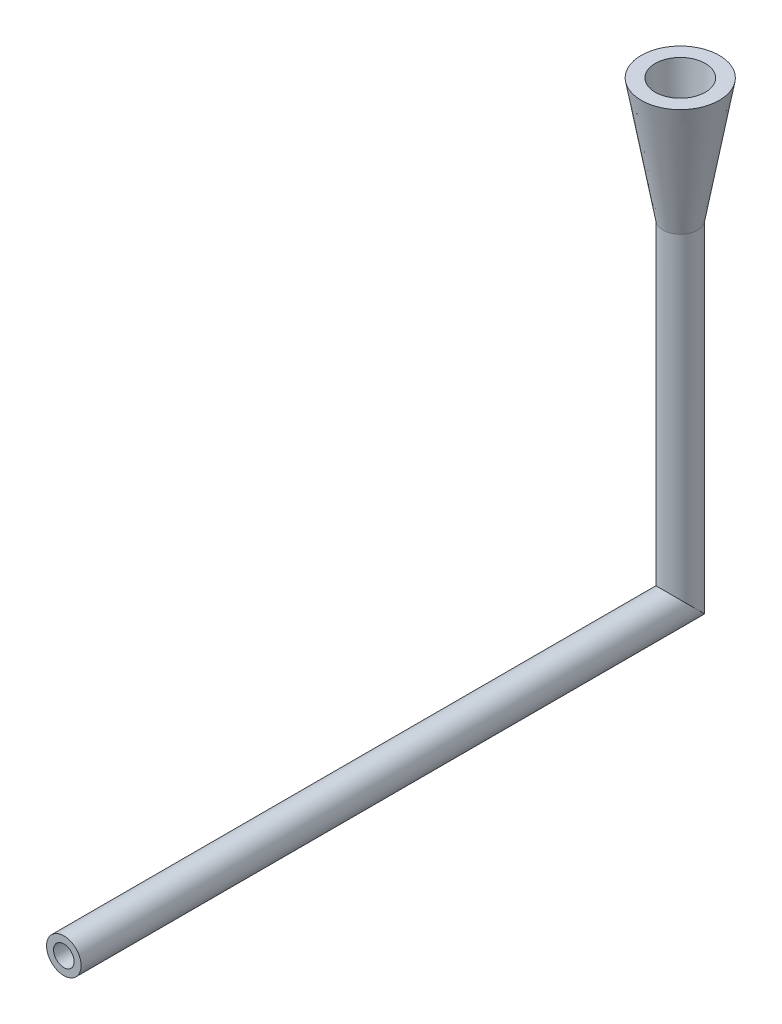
ISO-10303-21;
HEADER;
FILE_DESCRIPTION(('STEP AP214'),'2;1');
FILE_NAME('part.step','',(''),(''),'','','');
FILE_SCHEMA(('AUTOMOTIVE_DESIGN { 1 0 10303 214 1 1 1 1 }'));
ENDSEC;
DATA;
#1=APPLICATION_CONTEXT('core data for automotive mechanical design processes');
#2=APPLICATION_PROTOCOL_DEFINITION('international standard','automotive_design',2000,#1);
#3=PRODUCT_CONTEXT('',#1,'mechanical');
#4=PRODUCT('Part','Part','',(#3));
#5=PRODUCT_RELATED_PRODUCT_CATEGORY('part','',(#4));
#6=PRODUCT_DEFINITION_FORMATION('','',#4);
#7=PRODUCT_DEFINITION_CONTEXT('part definition',#1,'design');
#8=PRODUCT_DEFINITION('design','',#6,#7);
#9=PRODUCT_DEFINITION_SHAPE('','',#8);
#10=(LENGTH_UNIT() NAMED_UNIT(*) SI_UNIT(.MILLI.,.METRE.));
#11=(NAMED_UNIT(*) PLANE_ANGLE_UNIT() SI_UNIT($,.RADIAN.));
#12=(NAMED_UNIT(*) SI_UNIT($,.STERADIAN.) SOLID_ANGLE_UNIT());
#13=UNCERTAINTY_MEASURE_WITH_UNIT(LENGTH_MEASURE(1.E-05),#10,'distance_accuracy_value','');
#14=(GEOMETRIC_REPRESENTATION_CONTEXT(3) GLOBAL_UNCERTAINTY_ASSIGNED_CONTEXT((#13)) GLOBAL_UNIT_ASSIGNED_CONTEXT((#10,
#11,#12)) REPRESENTATION_CONTEXT('',''));
#15=CARTESIAN_POINT('',(0.,0.,0.));
#16=DIRECTION('',(0.,0.,1.));
#17=DIRECTION('',(1.,0.,0.));
#18=AXIS2_PLACEMENT_3D('',#15,#16,#17);
#19=CARTESIAN_POINT('',(0.,-23.5695999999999,-381.));
#20=DIRECTION('',(0.,1.,0.));
#21=DIRECTION('',(0.,0.,1.));
#22=AXIS2_PLACEMENT_3D('',#19,#20,#21);
#23=CYLINDRICAL_SURFACE('',#22,10.668);
#24=CARTESIAN_POINT('',(0.,0.,-381.));
#25=DIRECTION('',(0.,0.707106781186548,-0.707106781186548));
#26=DIRECTION('',(0.,-0.707106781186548,-0.707106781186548));
#27=AXIS2_PLACEMENT_3D('',#24,#25,#26);
#28=ELLIPSE('',#27,15.0868302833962,10.668);
#29=CARTESIAN_POINT('',(0.,-10.668,-391.668));
#30=VERTEX_POINT('',#29);
#31=EDGE_CURVE('E34',#30,#30,#28,.T.);
#32=ORIENTED_EDGE('',*,*,#31,.T.);
#33=EDGE_LOOP('',(#32));
#34=FACE_BOUND('',#33,.T.);
#35=CARTESIAN_POINT('',(0.,203.2,-381.));
#36=DIRECTION('',(0.,1.,0.));
#37=DIRECTION('',(0.,0.,1.));
#38=AXIS2_PLACEMENT_3D('',#35,#36,#37);
#39=CIRCLE('',#38,10.668);
#40=CARTESIAN_POINT('',(0.,203.2,-370.332));
#41=VERTEX_POINT('',#40);
#42=EDGE_CURVE('E49',#41,#41,#39,.T.);
#43=ORIENTED_EDGE('',*,*,#42,.F.);
#44=EDGE_LOOP('',(#43));
#45=FACE_BOUND('',#44,.T.);
#46=ADVANCED_FACE('F31',(#34,#45),#23,.T.);
#47=CARTESIAN_POINT('',(0.,0.,0.));
#48=DIRECTION('',(0.,0.,-1.));
#49=DIRECTION('',(-1.,0.,0.));
#50=AXIS2_PLACEMENT_3D('',#47,#48,#49);
#51=CYLINDRICAL_SURFACE('',#50,10.668);
#52=CARTESIAN_POINT('',(0.,0.,0.));
#53=DIRECTION('',(0.,0.,1.));
#54=DIRECTION('',(1.,0.,0.));
#55=AXIS2_PLACEMENT_3D('',#52,#53,#54);
#56=CIRCLE('',#55,10.668);
#57=CARTESIAN_POINT('',(10.668,0.,0.));
#58=VERTEX_POINT('',#57);
#59=EDGE_CURVE('E43',#58,#58,#56,.T.);
#60=ORIENTED_EDGE('',*,*,#59,.F.);
#61=EDGE_LOOP('',(#60));
#62=FACE_BOUND('',#61,.T.);
#63=ORIENTED_EDGE('',*,*,#31,.F.);
#64=EDGE_LOOP('',(#63));
#65=FACE_BOUND('',#64,.T.);
#66=ADVANCED_FACE('F99',(#62,#65),#51,.T.);
#67=CARTESIAN_POINT('',(0.,0.,0.));
#68=DIRECTION('',(0.,0.,1.));
#69=DIRECTION('',(1.,0.,0.));
#70=AXIS2_PLACEMENT_3D('',#67,#68,#69);
#71=PLANE('',#70);
#72=CARTESIAN_POINT('',(0.,0.,0.));
#73=DIRECTION('',(0.,0.,1.));
#74=DIRECTION('',(1.,0.,0.));
#75=AXIS2_PLACEMENT_3D('',#72,#73,#74);
#76=CIRCLE('',#75,6.35);
#77=CARTESIAN_POINT('',(6.35,0.,0.));
#78=VERTEX_POINT('',#77);
#79=EDGE_CURVE('E38',#78,#78,#76,.F.);
#80=ORIENTED_EDGE('',*,*,#79,.T.);
#81=EDGE_LOOP('',(#80));
#82=FACE_BOUND('',#81,.T.);
#83=ORIENTED_EDGE('',*,*,#59,.T.);
#84=EDGE_LOOP('',(#83));
#85=FACE_BOUND('',#84,.T.);
#86=ADVANCED_FACE('F93',(#82,#85),#71,.T.);
#87=CARTESIAN_POINT('',(0.,-14.0699999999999,-381.));
#88=DIRECTION('',(0.,1.,0.));
#89=DIRECTION('',(0.,0.,1.));
#90=AXIS2_PLACEMENT_3D('',#87,#88,#89);
#91=CYLINDRICAL_SURFACE('',#90,6.35);
#92=CARTESIAN_POINT('',(0.,0.,-381.));
#93=DIRECTION('',(0.,0.707106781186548,-0.707106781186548));
#94=DIRECTION('',(0.,-0.707106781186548,-0.707106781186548));
#95=AXIS2_PLACEMENT_3D('',#92,#93,#94);
#96=ELLIPSE('',#95,8.98025612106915,6.35);
#97=CARTESIAN_POINT('',(0.,-6.35,-387.35));
#98=VERTEX_POINT('',#97);
#99=EDGE_CURVE('E10',#98,#98,#96,.F.);
#100=ORIENTED_EDGE('',*,*,#99,.T.);
#101=EDGE_LOOP('',(#100));
#102=FACE_BOUND('',#101,.T.);
#103=CARTESIAN_POINT('',(0.,203.2,-381.));
#104=DIRECTION('',(0.,-1.,0.));
#105=DIRECTION('',(1.,0.,0.));
#106=AXIS2_PLACEMENT_3D('',#103,#104,#105);
#107=CIRCLE('',#106,6.35);
#108=CARTESIAN_POINT('',(6.35,203.2,-381.));
#109=VERTEX_POINT('',#108);
#110=EDGE_CURVE('E47',#109,#109,#107,.F.);
#111=ORIENTED_EDGE('',*,*,#110,.T.);
#112=EDGE_LOOP('',(#111));
#113=FACE_BOUND('',#112,.T.);
#114=ADVANCED_FACE('F87',(#102,#113),#91,.F.);
#115=CARTESIAN_POINT('',(0.,0.,0.));
#116=DIRECTION('',(0.,0.,-1.));
#117=DIRECTION('',(-1.,0.,0.));
#118=AXIS2_PLACEMENT_3D('',#115,#116,#117);
#119=CYLINDRICAL_SURFACE('',#118,6.35);
#120=ORIENTED_EDGE('',*,*,#79,.F.);
#121=EDGE_LOOP('',(#120));
#122=FACE_BOUND('',#121,.T.);
#123=ORIENTED_EDGE('',*,*,#99,.F.);
#124=EDGE_LOOP('',(#123));
#125=FACE_BOUND('',#124,.T.);
#126=ADVANCED_FACE('F83',(#122,#125),#119,.F.);
#127=CARTESIAN_POINT('',(0.,203.2,-381.));
#128=DIRECTION('',(0.,1.,0.));
#129=DIRECTION('',(0.,0.,1.));
#130=AXIS2_PLACEMENT_3D('',#127,#128,#129);
#131=CONICAL_SURFACE('',#130,10.668,0.174532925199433);
#132=CARTESIAN_POINT('',(0.,279.4,-381.));
#133=DIRECTION('',(0.,1.,0.));
#134=DIRECTION('',(0.,0.,1.));
#135=AXIS2_PLACEMENT_3D('',#132,#133,#134);
#136=CIRCLE('',#135,24.104115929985);
#137=CARTESIAN_POINT('',(0.,279.4,-356.895884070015));
#138=VERTEX_POINT('',#137);
#139=EDGE_CURVE('E55',#138,#138,#136,.T.);
#140=ORIENTED_EDGE('',*,*,#139,.F.);
#141=EDGE_LOOP('',(#140));
#142=FACE_BOUND('',#141,.T.);
#143=ORIENTED_EDGE('',*,*,#42,.T.);
#144=EDGE_LOOP('',(#143));
#145=FACE_BOUND('',#144,.T.);
#146=ADVANCED_FACE('F74',(#142,#145),#131,.T.);
#147=CARTESIAN_POINT('',(0.,279.4,-381.));
#148=DIRECTION('',(0.,1.,0.));
#149=DIRECTION('',(0.,0.,1.));
#150=AXIS2_PLACEMENT_3D('',#147,#148,#149);
#151=PLANE('',#150);
#152=CARTESIAN_POINT('',(0.,279.4,-381.));
#153=DIRECTION('',(0.,1.,0.));
#154=DIRECTION('',(0.,0.,1.));
#155=AXIS2_PLACEMENT_3D('',#152,#153,#154);
#156=CIRCLE('',#155,15.4681159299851);
#157=CARTESIAN_POINT('',(0.,279.4,-365.531884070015));
#158=VERTEX_POINT('',#157);
#159=EDGE_CURVE('E66',#158,#158,#156,.T.);
#160=ORIENTED_EDGE('',*,*,#159,.F.);
#161=EDGE_LOOP('',(#160));
#162=FACE_BOUND('',#161,.T.);
#163=ORIENTED_EDGE('',*,*,#139,.T.);
#164=EDGE_LOOP('',(#163));
#165=FACE_BOUND('',#164,.T.);
#166=ADVANCED_FACE('F72',(#162,#165),#151,.T.);
#167=CARTESIAN_POINT('',(0.,279.4,-381.));
#168=DIRECTION('',(0.,1.,0.));
#169=DIRECTION('',(0.,0.,1.));
#170=AXIS2_PLACEMENT_3D('',#167,#168,#169);
#171=CONICAL_SURFACE('',#170,15.4681159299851,0.10471975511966);
#172=CARTESIAN_POINT('',(0.,203.2,-381.));
#173=DIRECTION('',(0.,1.,0.));
#174=DIRECTION('',(0.,0.,1.));
#175=AXIS2_PLACEMENT_3D('',#172,#173,#174);
#176=CIRCLE('',#175,7.45917320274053);
#177=CARTESIAN_POINT('',(0.,203.2,-373.540826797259));
#178=VERTEX_POINT('',#177);
#179=EDGE_CURVE('E50',#178,#178,#176,.T.);
#180=ORIENTED_EDGE('',*,*,#179,.F.);
#181=EDGE_LOOP('',(#180));
#182=FACE_BOUND('',#181,.T.);
#183=ORIENTED_EDGE('',*,*,#159,.T.);
#184=EDGE_LOOP('',(#183));
#185=FACE_BOUND('',#184,.T.);
#186=ADVANCED_FACE('F70',(#182,#185),#171,.F.);
#187=CARTESIAN_POINT('',(0.,203.2,-381.));
#188=DIRECTION('',(0.,1.,0.));
#189=DIRECTION('',(0.,0.,1.));
#190=AXIS2_PLACEMENT_3D('',#187,#188,#189);
#191=PLANE('',#190);
#192=ORIENTED_EDGE('',*,*,#110,.F.);
#193=EDGE_LOOP('',(#192));
#194=FACE_BOUND('',#193,.T.);
#195=ORIENTED_EDGE('',*,*,#179,.T.);
#196=EDGE_LOOP('',(#195));
#197=FACE_BOUND('',#196,.T.);
#198=ADVANCED_FACE('F80',(#194,#197),#191,.T.);
#199=CLOSED_SHELL('',(#46,#66,#86,#114,#126,#146,#166,#186,#198));
#200=MANIFOLD_SOLID_BREP('B2',#199);
#201=ADVANCED_BREP_SHAPE_REPRESENTATION('',(#18,#200),#14);
#202=SHAPE_DEFINITION_REPRESENTATION(#9,#201);
ENDSEC;
END-ISO-10303-21;
